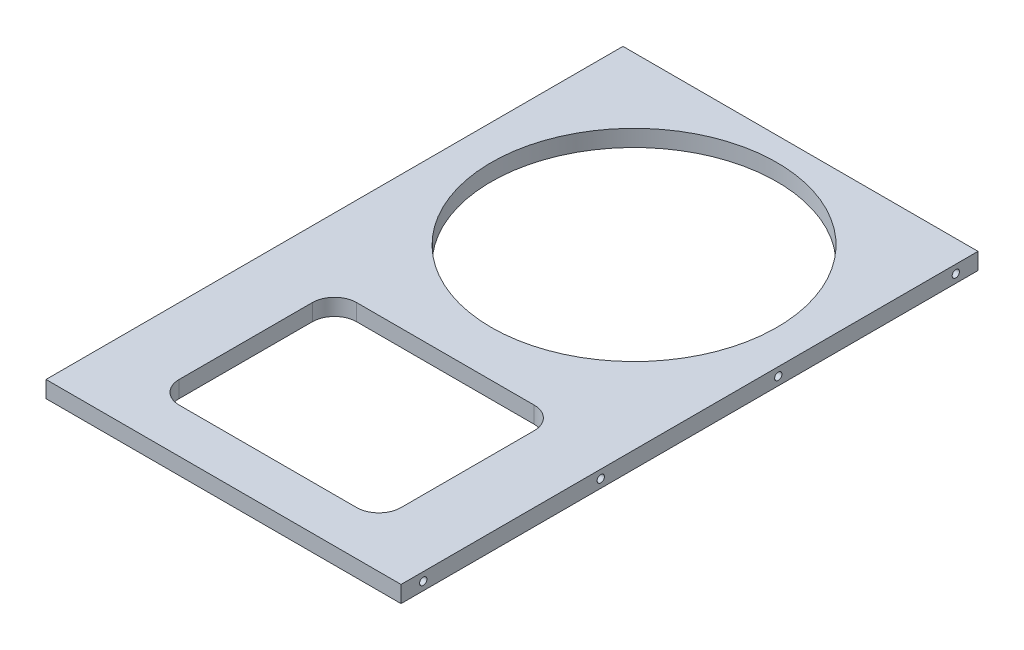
from build123d import *

# Parameters (mm, degrees)
SKETCH1_W          = 203.2
SKETCH1_H          = 330.2
EXTRUDE1_DEPTH     = 9.525
SKETCH2_R          = 2.0828
EXTRUDE2_DEPTH     = 19.05
EXTRUDE3_START     = -19.05
SKETCH3_R          = 2.0828
EXTRUDE3_DEPTH     = 19.05
SKETCH4_R          = 81.75625
CUT_EXTRUDE1_DEPTH = 388.831156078
CUT_EXTRUDE2_DEPTH = 388.831156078


with BuildPart() as part:
    # Sketch1 → Extrude1 (new body)
    with BuildSketch(Plane(origin=(0, 0, 0), x_dir=(1, 0, 0), z_dir=(0, 1, 0))):
        with Locations((101.6, 165.1)):
            Rectangle(SKETCH1_W, SKETCH1_H)
    extrude(amount=EXTRUDE1_DEPTH)

    # Sketch2 → Extrude2 (cut)
    with BuildSketch(Plane(origin=(203.2, 0, 0), x_dir=(0, 0, -1), z_dir=(1, 0, 0))):
        with Locations((12.7, 4.7625)):
            Circle(SKETCH2_R)
        with Locations((114.3, 4.7625)):
            Circle(SKETCH2_R)
        with Locations((215.9, 4.7625)):
            Circle(SKETCH2_R)
        with Locations((317.5, 4.7625)):
            Circle(SKETCH2_R)
    extrude(amount=-EXTRUDE2_DEPTH, mode=Mode.SUBTRACT)

    # Sketch3 → Extrude3 (cut)
    with BuildSketch(Plane.ZY.offset(EXTRUDE3_START)):
        with Locations(Location((-12.7, 4.7625, 0), (0, 0, 180))):
            Circle(SKETCH3_R)
        with Locations(Location((-114.3, 4.7625, 0), (0, 0, 180))):
            Circle(SKETCH3_R)
        with Locations(Location((-215.9, 4.7625, 0), (0, 0, 180))):
            Circle(SKETCH3_R)
        with Locations(Location((-317.5, 4.7625, 0), (0, 0, 180))):
            Circle(SKETCH3_R)
    extrude(amount=EXTRUDE3_DEPTH, mode=Mode.SUBTRACT)

    # Sketch4 → Cut-Extrude1 (cut, through all)
    with BuildSketch(Plane(origin=(0, 9.525, 0), x_dir=(1, 0, 0), z_dir=(0, 1, 0))):
        with Locations(Location((101.6, 234.95, 0), (0, 0, 270))):
            Circle(SKETCH4_R)
    extrude(amount=-CUT_EXTRUDE1_DEPTH, mode=Mode.SUBTRACT)

    # Sketch5 → Cut-Extrude2 (cut, through all)
    with BuildSketch(Plane(origin=(0, 9.525, 0), x_dir=(1, 0, 0), z_dir=(0, 1, 0))):
        with BuildLine():
            Line((50.8, 127), (152.4, 127))
            ThreePointArc((152.4, 127), (161.380256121, 123.280256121), (165.1, 114.3))
            Line((165.1, 114.3), (165.1, 38.1))
            ThreePointArc((165.1, 38.1), (161.380256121, 29.119743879), (152.4, 25.4))
            Line((152.4, 25.4), (50.8, 25.4))
            ThreePointArc((50.8, 25.4), (41.819743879, 29.119743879), (38.1, 38.1))
            Line((38.1, 38.1), (38.1, 114.3))
            ThreePointArc((38.1, 114.3), (41.819743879, 123.280256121), (50.8, 127))
        make_face()
    extrude(amount=-CUT_EXTRUDE2_DEPTH, mode=Mode.SUBTRACT)


solid = part.part
